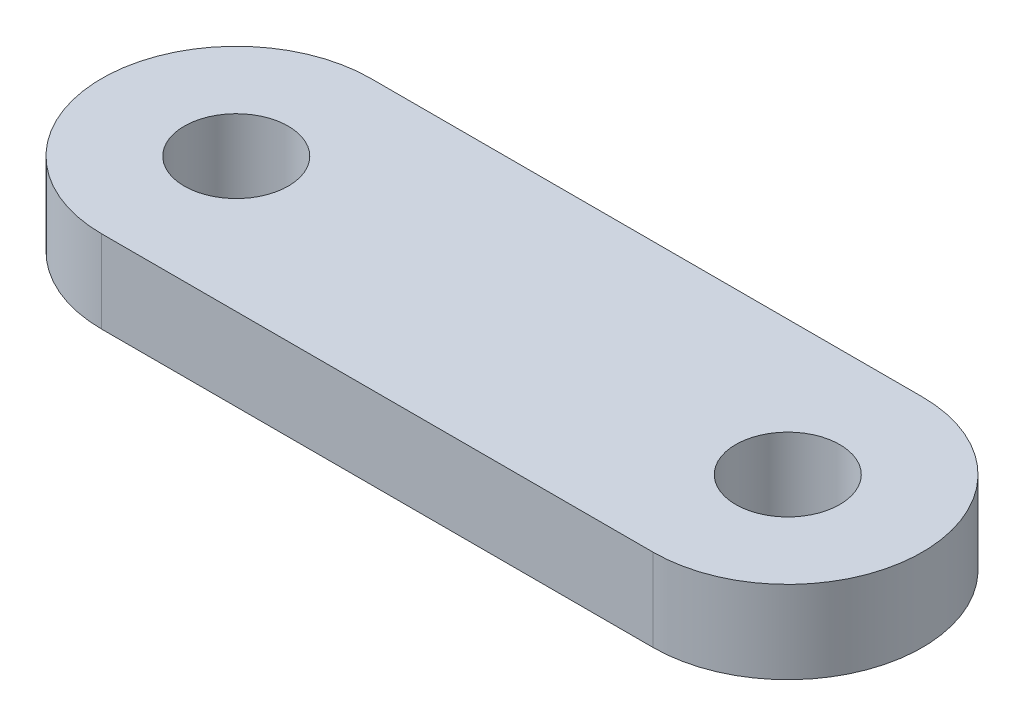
from build123d import *

# Parameters (mm, degrees)
SKETCH1_R           = 2
BOSS_EXTRUDE1_DEPTH = 1.5875


with BuildPart() as part:
    # Sketch1 → Boss-Extrude1 (new, symmetric)
    with BuildSketch(Plane(origin=(0, 0, 0), x_dir=(1, 0, 0), z_dir=(0, 1, 0))):
        with BuildLine():
            Line((-10.6045, 5.175), (10.6045, 5.175))
            ThreePointArc((10.6045, 5.175), (15.7795, 0), (10.6045, -5.175))
            Line((10.6045, -5.175), (-10.6045, -5.175))
            ThreePointArc((-10.6045, -5.175), (-15.7795, 0), (-10.6045, 5.175))
        make_face()
        with Locations(Location((-10.6045, 0, 0), (0, 0, 270))):
            Circle(SKETCH1_R, mode=Mode.SUBTRACT)
        with Locations(Location((10.6045, 0, 0), (0, 0, 270))):
            Circle(SKETCH1_R, mode=Mode.SUBTRACT)
    extrude(amount=BOSS_EXTRUDE1_DEPTH, both=True)


solid = part.part
